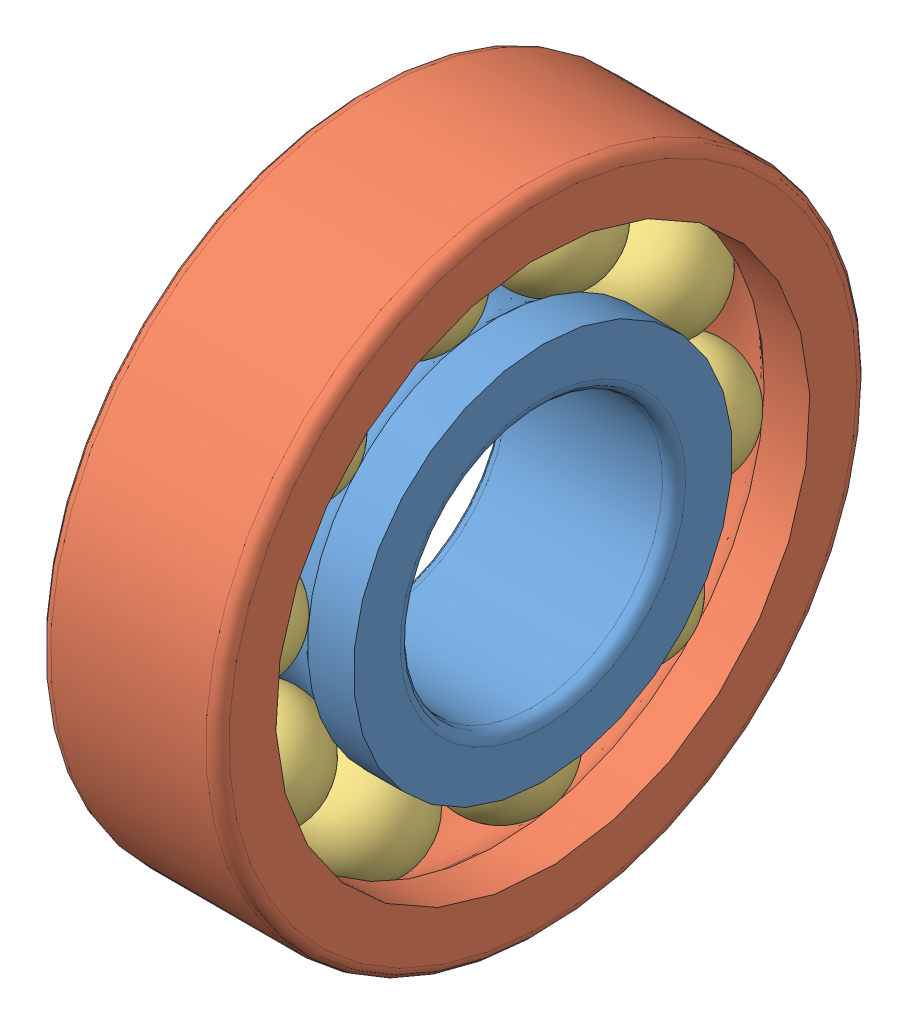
SolidWorks assembly Roulement radial à une rangée de billes 25x62x17.SLDASM, configuration Défaut (file format 4400). Lengths in mm.
Overall size (17 72.05 72.05).
15 component instances, 3 part files, 4 mates.
Components (placement in the parent):
- Roulement_r1rb_Bint54-1: Roulement_r1rb_Bint54.SLDPRT [Défaut] at origin size (17 36.1 36.1)
- Roulement_r1rb_Bext54-1: Roulement_r1rb_Bext54.SLDPRT [Défaut] x (1 0 0) z (0 0.178134 0.984006) size (17 62 62)
- Roulement_r1rb_Eroul54-1: Roulement_r1rb_Eroul54.SLDPRT [Défaut] x (1 0 0) z (0 0.412348 0.911027) size (11.1 11.1 11.1)
- Roulement_r1rb_Eroul54-10: Roulement_r1rb_Eroul54.SLDPRT [Défaut] x (1 0 0) z (0 -0.201892 0.979408) size (11.1 11.1 11.1)
- Roulement_r1rb_Eroul54-11: Roulement_r1rb_Eroul54.SLDPRT [Défaut] x (1 0 0) z (0 -0.739015 0.673688) size (11.1 11.1 11.1)
- Roulement_r1rb_Eroul54-12: Roulement_r1rb_Eroul54.SLDPRT [Défaut] x (1 0 0) z (0 -0.99386 0.110643) size (11.1 11.1 11.1)
- Roulement_r1rb_Eroul54-13: Roulement_r1rb_Eroul54.SLDPRT [Défaut] x (1 0 0) z (0 -0.869084 -0.494664) size (11.1 11.1 11.1)
- Roulement_r1rb_Eroul54-14: Roulement_r1rb_Eroul54.SLDPRT [Défaut] x (1 0 0) z (0 -0.412348 -0.911027) size (11.1 11.1 11.1)
- Roulement_r1rb_Eroul54-15: Roulement_r1rb_Eroul54.SLDPRT [Défaut] x (1 0 0) z (0 0.201892 -0.979408) size (11.1 11.1 11.1)
- Roulement_r1rb_Eroul54-16: Roulement_r1rb_Eroul54.SLDPRT [Défaut] x (1 0 0) z (0 0.739015 -0.673688) size (11.1 11.1 11.1)
- Roulement_r1rb_Eroul54-17: Roulement_r1rb_Eroul54.SLDPRT [Défaut] x (1 0 0) z (0 -0.911027 0.412348) size (11.1 11.1 11.1) (suppressed, hidden)
- Roulement_r1rb_Eroul54-18: Roulement_r1rb_Eroul54.SLDPRT [Défaut] x (1 0 0) z (0 -0.412348 -0.911027) size (11.1 11.1 11.1) (suppressed, hidden)
- Roulement_r1rb_Eroul54-19: Roulement_r1rb_Eroul54.SLDPRT [Défaut] x (1 0 0) z (0 0.911027 -0.412348) size (11.1 11.1 11.1) (suppressed, hidden)
- Roulement_r1rb_Eroul54-20: Roulement_r1rb_Eroul54.SLDPRT [Défaut] x (1 0 0) z (0 0.99386 -0.110643) size (11.1 11.1 11.1)
- Roulement_r1rb_Eroul54-21: Roulement_r1rb_Eroul54.SLDPRT [Défaut] x (1 0 0) z (0 0.869084 0.494664) size (11.1 11.1 11.1)
Mates (geometry in assembly coordinates):
- Coaxiale1: concentric aligned: cylinder of Roulement_r1rb_Bint54-1 through (0 0 0) axis (-1 0 0) radius 12.5; cylinder of Roulement_r1rb_Bext54-1 through (0 0 0) axis (-1 0 0) radius 31
- Coïncidente1: coincident: point of Roulement_r1rb_Bext54-1; point of assembly
- Coïncidente2: coincident aligned: line of Roulement_r1rb_Bint54-1 through (0 0 0) axis (1 0 0); line of Roulement_r1rb_Eroul54-1 through (0 0 0) axis (1 0 0)
- Coïncidente3: coincident: unknown of Roulement_r1rb_Eroul54-1
